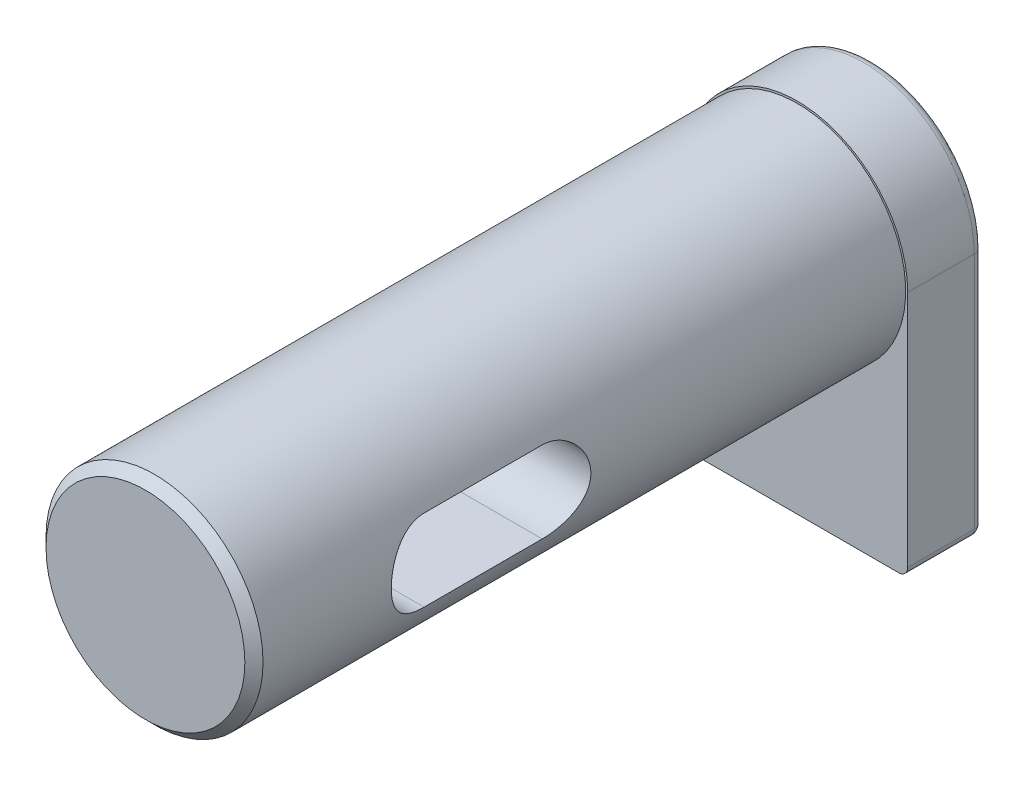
ISO-10303-21;
HEADER;
FILE_DESCRIPTION(('STEP AP214'),'2;1');
FILE_NAME('part.step','',(''),(''),'','','');
FILE_SCHEMA(('AUTOMOTIVE_DESIGN { 1 0 10303 214 1 1 1 1 }'));
ENDSEC;
DATA;
#1=APPLICATION_CONTEXT('core data for automotive mechanical design processes');
#2=APPLICATION_PROTOCOL_DEFINITION('international standard','automotive_design',2000,#1);
#3=PRODUCT_CONTEXT('',#1,'mechanical');
#4=PRODUCT('Part','Part','',(#3));
#5=PRODUCT_RELATED_PRODUCT_CATEGORY('part','',(#4));
#6=PRODUCT_DEFINITION_FORMATION('','',#4);
#7=PRODUCT_DEFINITION_CONTEXT('part definition',#1,'design');
#8=PRODUCT_DEFINITION('design','',#6,#7);
#9=PRODUCT_DEFINITION_SHAPE('','',#8);
#10=(LENGTH_UNIT() NAMED_UNIT(*) SI_UNIT(.MILLI.,.METRE.));
#11=(NAMED_UNIT(*) PLANE_ANGLE_UNIT() SI_UNIT($,.RADIAN.));
#12=(NAMED_UNIT(*) SI_UNIT($,.STERADIAN.) SOLID_ANGLE_UNIT());
#13=UNCERTAINTY_MEASURE_WITH_UNIT(LENGTH_MEASURE(1.E-05),#10,'distance_accuracy_value','');
#14=(GEOMETRIC_REPRESENTATION_CONTEXT(3) GLOBAL_UNCERTAINTY_ASSIGNED_CONTEXT((#13)) GLOBAL_UNIT_ASSIGNED_CONTEXT((#10,
#11,#12)) REPRESENTATION_CONTEXT('',''));
#15=CARTESIAN_POINT('',(0.,0.,0.));
#16=DIRECTION('',(0.,0.,1.));
#17=DIRECTION('',(1.,0.,0.));
#18=AXIS2_PLACEMENT_3D('',#15,#16,#17);
#19=CARTESIAN_POINT('',(0.,0.,3.302));
#20=DIRECTION('',(0.,0.,-1.));
#21=DIRECTION('',(-1.,0.,0.));
#22=AXIS2_PLACEMENT_3D('',#19,#20,#21);
#23=PLANE('',#22);
#24=CARTESIAN_POINT('',(0.,0.,3.302));
#25=DIRECTION('',(0.,0.,1.));
#26=DIRECTION('',(-1.,0.,0.));
#27=AXIS2_PLACEMENT_3D('',#24,#25,#26);
#28=CIRCLE('',#27,4.826);
#29=CARTESIAN_POINT('',(4.826,0.,3.302));
#30=VERTEX_POINT('',#29);
#31=CARTESIAN_POINT('',(-4.826,0.,3.302));
#32=VERTEX_POINT('',#31);
#33=EDGE_CURVE('E230',#30,#32,#28,.T.);
#34=ORIENTED_EDGE('',*,*,#33,.T.);
#35=DIRECTION('',(0.,-1.,0.));
#36=VECTOR('',#35,1.);
#37=CARTESIAN_POINT('',(-4.826,-10.398125,3.302));
#38=LINE('',#37,#36);
#39=CARTESIAN_POINT('',(-4.826,-10.398125,3.302));
#40=VERTEX_POINT('',#39);
#41=EDGE_CURVE('E228',#32,#40,#38,.T.);
#42=ORIENTED_EDGE('',*,*,#41,.T.);
#43=CARTESIAN_POINT('',(-4.429125,-10.398125,3.302));
#44=DIRECTION('',(0.,0.,1.));
#45=DIRECTION('',(-1.,0.,0.));
#46=AXIS2_PLACEMENT_3D('',#43,#44,#45);
#47=CIRCLE('',#46,0.396875);
#48=CARTESIAN_POINT('',(-4.429125,-10.795,3.302));
#49=VERTEX_POINT('',#48);
#50=EDGE_CURVE('E226',#40,#49,#47,.T.);
#51=ORIENTED_EDGE('',*,*,#50,.T.);
#52=DIRECTION('',(1.,0.,0.));
#53=VECTOR('',#52,1.);
#54=CARTESIAN_POINT('',(4.429125,-10.795,3.302));
#55=LINE('',#54,#53);
#56=CARTESIAN_POINT('',(4.429125,-10.795,3.302));
#57=VERTEX_POINT('',#56);
#58=EDGE_CURVE('E224',#49,#57,#55,.T.);
#59=ORIENTED_EDGE('',*,*,#58,.T.);
#60=CARTESIAN_POINT('',(4.429125,-10.398125,3.302));
#61=DIRECTION('',(0.,0.,1.));
#62=DIRECTION('',(-1.,0.,0.));
#63=AXIS2_PLACEMENT_3D('',#60,#61,#62);
#64=CIRCLE('',#63,0.396875);
#65=CARTESIAN_POINT('',(4.826,-10.398125,3.302));
#66=VERTEX_POINT('',#65);
#67=EDGE_CURVE('E222',#57,#66,#64,.T.);
#68=ORIENTED_EDGE('',*,*,#67,.T.);
#69=DIRECTION('',(0.,1.,0.));
#70=VECTOR('',#69,1.);
#71=CARTESIAN_POINT('',(4.826,0.,3.302));
#72=LINE('',#71,#70);
#73=EDGE_CURVE('E220',#66,#30,#72,.T.);
#74=ORIENTED_EDGE('',*,*,#73,.T.);
#75=EDGE_LOOP('',(#34,#42,#51,#59,#68,#74));
#76=FACE_BOUND('',#75,.T.);
#77=CARTESIAN_POINT('',(0.,0.,3.302));
#78=DIRECTION('',(0.,0.,-1.));
#79=DIRECTION('',(-1.,0.,0.));
#80=AXIS2_PLACEMENT_3D('',#77,#78,#79);
#81=CIRCLE('',#80,4.7371);
#82=CARTESIAN_POINT('',(-4.7371,0.,3.302));
#83=VERTEX_POINT('',#82);
#84=EDGE_CURVE('E202',#83,#83,#81,.F.);
#85=ORIENTED_EDGE('',*,*,#84,.F.);
#86=EDGE_LOOP('',(#85));
#87=FACE_BOUND('',#86,.T.);
#88=ADVANCED_FACE('F37',(#76,#87),#23,.F.);
#89=CARTESIAN_POINT('',(0.,0.,3.302));
#90=DIRECTION('',(0.,0.,-1.));
#91=DIRECTION('',(-1.,0.,0.));
#92=AXIS2_PLACEMENT_3D('',#89,#90,#91);
#93=CYLINDRICAL_SURFACE('',#92,4.826);
#94=DIRECTION('',(0.,0.,-1.));
#95=VECTOR('',#94,1.);
#96=CARTESIAN_POINT('',(4.826,0.,3.302));
#97=LINE('',#96,#95);
#98=CARTESIAN_POINT('',(4.826,0.,0.396875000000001));
#99=VERTEX_POINT('',#98);
#100=EDGE_CURVE('E218',#30,#99,#97,.T.);
#101=ORIENTED_EDGE('',*,*,#100,.T.);
#102=CARTESIAN_POINT('',(0.,0.,0.396875));
#103=DIRECTION('',(0.,0.,-1.));
#104=DIRECTION('',(-1.,0.,0.));
#105=AXIS2_PLACEMENT_3D('',#102,#103,#104);
#106=CIRCLE('',#105,4.826);
#107=CARTESIAN_POINT('',(-4.826,0.,0.396875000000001));
#108=VERTEX_POINT('',#107);
#109=EDGE_CURVE('E52',#99,#108,#106,.F.);
#110=ORIENTED_EDGE('',*,*,#109,.T.);
#111=DIRECTION('',(0.,0.,-1.));
#112=VECTOR('',#111,1.);
#113=CARTESIAN_POINT('',(-4.826,0.,3.302));
#114=LINE('',#113,#112);
#115=EDGE_CURVE('E205',#32,#108,#114,.T.);
#116=ORIENTED_EDGE('',*,*,#115,.F.);
#117=ORIENTED_EDGE('',*,*,#33,.F.);
#118=EDGE_LOOP('',(#101,#110,#116,#117));
#119=FACE_BOUND('',#118,.T.);
#120=ADVANCED_FACE('F246',(#119),#93,.T.);
#121=CARTESIAN_POINT('',(-4.826,-10.398125,3.302));
#122=DIRECTION('',(1.,0.,0.));
#123=DIRECTION('',(0.,1.,0.));
#124=AXIS2_PLACEMENT_3D('',#121,#122,#123);
#125=PLANE('',#124);
#126=ORIENTED_EDGE('',*,*,#115,.T.);
#127=DIRECTION('',(0.,-1.,0.));
#128=VECTOR('',#127,1.);
#129=CARTESIAN_POINT('',(-4.826,-10.398125,0.396875));
#130=LINE('',#129,#128);
#131=CARTESIAN_POINT('',(-4.826,-10.398125,0.396875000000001));
#132=VERTEX_POINT('',#131);
#133=EDGE_CURVE('E59',#108,#132,#130,.T.);
#134=ORIENTED_EDGE('',*,*,#133,.T.);
#135=DIRECTION('',(0.,0.,-1.));
#136=VECTOR('',#135,1.);
#137=CARTESIAN_POINT('',(-4.826,-10.398125,3.302));
#138=LINE('',#137,#136);
#139=EDGE_CURVE('E207',#40,#132,#138,.T.);
#140=ORIENTED_EDGE('',*,*,#139,.F.);
#141=ORIENTED_EDGE('',*,*,#41,.F.);
#142=EDGE_LOOP('',(#126,#134,#140,#141));
#143=FACE_BOUND('',#142,.T.);
#144=ADVANCED_FACE('F252',(#143),#125,.F.);
#145=CARTESIAN_POINT('',(-4.429125,-10.398125,3.302));
#146=DIRECTION('',(0.,0.,-1.));
#147=DIRECTION('',(-1.,0.,0.));
#148=AXIS2_PLACEMENT_3D('',#145,#146,#147);
#149=CYLINDRICAL_SURFACE('',#148,0.396875);
#150=ORIENTED_EDGE('',*,*,#139,.T.);
#151=CARTESIAN_POINT('',(-4.429125,-10.398125,0.396875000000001));
#152=DIRECTION('',(0.,0.,-1.));
#153=DIRECTION('',(-1.,0.,0.));
#154=AXIS2_PLACEMENT_3D('',#151,#152,#153);
#155=CIRCLE('',#154,0.396875);
#156=CARTESIAN_POINT('',(-4.429125,-10.795,0.396875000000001));
#157=VERTEX_POINT('',#156);
#158=EDGE_CURVE('E311',#132,#157,#155,.F.);
#159=ORIENTED_EDGE('',*,*,#158,.T.);
#160=DIRECTION('',(0.,0.,-1.));
#161=VECTOR('',#160,1.);
#162=CARTESIAN_POINT('',(-4.429125,-10.795,3.302));
#163=LINE('',#162,#161);
#164=EDGE_CURVE('E209',#49,#157,#163,.T.);
#165=ORIENTED_EDGE('',*,*,#164,.F.);
#166=ORIENTED_EDGE('',*,*,#50,.F.);
#167=EDGE_LOOP('',(#150,#159,#165,#166));
#168=FACE_BOUND('',#167,.T.);
#169=ADVANCED_FACE('F271',(#168),#149,.T.);
#170=CARTESIAN_POINT('',(4.429125,-10.795,3.302));
#171=DIRECTION('',(0.,1.,0.));
#172=DIRECTION('',(-1.,0.,0.));
#173=AXIS2_PLACEMENT_3D('',#170,#171,#172);
#174=PLANE('',#173);
#175=ORIENTED_EDGE('',*,*,#164,.T.);
#176=DIRECTION('',(1.,0.,0.));
#177=VECTOR('',#176,1.);
#178=CARTESIAN_POINT('',(4.429125,-10.795,0.396875));
#179=LINE('',#178,#177);
#180=CARTESIAN_POINT('',(4.429125,-10.795,0.396875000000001));
#181=VERTEX_POINT('',#180);
#182=EDGE_CURVE('E328',#157,#181,#179,.T.);
#183=ORIENTED_EDGE('',*,*,#182,.T.);
#184=DIRECTION('',(0.,0.,-1.));
#185=VECTOR('',#184,1.);
#186=CARTESIAN_POINT('',(4.429125,-10.795,3.302));
#187=LINE('',#186,#185);
#188=EDGE_CURVE('E212',#57,#181,#187,.T.);
#189=ORIENTED_EDGE('',*,*,#188,.F.);
#190=ORIENTED_EDGE('',*,*,#58,.F.);
#191=EDGE_LOOP('',(#175,#183,#189,#190));
#192=FACE_BOUND('',#191,.T.);
#193=ADVANCED_FACE('F267',(#192),#174,.F.);
#194=CARTESIAN_POINT('',(4.429125,-10.398125,3.302));
#195=DIRECTION('',(0.,0.,-1.));
#196=DIRECTION('',(-1.,0.,0.));
#197=AXIS2_PLACEMENT_3D('',#194,#195,#196);
#198=CYLINDRICAL_SURFACE('',#197,0.396875);
#199=ORIENTED_EDGE('',*,*,#188,.T.);
#200=CARTESIAN_POINT('',(4.429125,-10.398125,0.396875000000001));
#201=DIRECTION('',(0.,0.,-1.));
#202=DIRECTION('',(-1.,0.,0.));
#203=AXIS2_PLACEMENT_3D('',#200,#201,#202);
#204=CIRCLE('',#203,0.396875);
#205=CARTESIAN_POINT('',(4.826,-10.398125,0.396875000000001));
#206=VERTEX_POINT('',#205);
#207=EDGE_CURVE('E326',#181,#206,#204,.F.);
#208=ORIENTED_EDGE('',*,*,#207,.T.);
#209=DIRECTION('',(0.,0.,-1.));
#210=VECTOR('',#209,1.);
#211=CARTESIAN_POINT('',(4.826,-10.398125,3.302));
#212=LINE('',#211,#210);
#213=EDGE_CURVE('E215',#66,#206,#212,.T.);
#214=ORIENTED_EDGE('',*,*,#213,.F.);
#215=ORIENTED_EDGE('',*,*,#67,.F.);
#216=EDGE_LOOP('',(#199,#208,#214,#215));
#217=FACE_BOUND('',#216,.T.);
#218=ADVANCED_FACE('F263',(#217),#198,.T.);
#219=CARTESIAN_POINT('',(4.826,0.,3.302));
#220=DIRECTION('',(-1.,0.,0.));
#221=DIRECTION('',(0.,0.,1.));
#222=AXIS2_PLACEMENT_3D('',#219,#220,#221);
#223=PLANE('',#222);
#224=ORIENTED_EDGE('',*,*,#213,.T.);
#225=DIRECTION('',(0.,1.,0.));
#226=VECTOR('',#225,1.);
#227=CARTESIAN_POINT('',(4.826,0.,0.396875));
#228=LINE('',#227,#226);
#229=EDGE_CURVE('E155',#206,#99,#228,.T.);
#230=ORIENTED_EDGE('',*,*,#229,.T.);
#231=ORIENTED_EDGE('',*,*,#100,.F.);
#232=ORIENTED_EDGE('',*,*,#73,.F.);
#233=EDGE_LOOP('',(#224,#230,#231,#232));
#234=FACE_BOUND('',#233,.T.);
#235=ADVANCED_FACE('F259',(#234),#223,.F.);
#236=CARTESIAN_POINT('',(0.,0.,0.));
#237=DIRECTION('',(0.,0.,-1.));
#238=DIRECTION('',(-1.,0.,0.));
#239=AXIS2_PLACEMENT_3D('',#236,#237,#238);
#240=PLANE('',#239);
#241=CARTESIAN_POINT('',(0.,0.,0.));
#242=DIRECTION('',(0.,0.,-1.));
#243=DIRECTION('',(-1.,0.,0.));
#244=AXIS2_PLACEMENT_3D('',#241,#242,#243);
#245=CIRCLE('',#244,4.429125);
#246=CARTESIAN_POINT('',(-4.429125,0.,0.));
#247=VERTEX_POINT('',#246);
#248=CARTESIAN_POINT('',(4.429125,0.,0.));
#249=VERTEX_POINT('',#248);
#250=EDGE_CURVE('E158',#247,#249,#245,.T.);
#251=ORIENTED_EDGE('',*,*,#250,.T.);
#252=DIRECTION('',(0.,1.,0.));
#253=VECTOR('',#252,1.);
#254=CARTESIAN_POINT('',(4.429125,-10.398125,0.));
#255=LINE('',#254,#253);
#256=CARTESIAN_POINT('',(4.429125,-10.398125,0.));
#257=VERTEX_POINT('',#256);
#258=EDGE_CURVE('E321',#249,#257,#255,.F.);
#259=ORIENTED_EDGE('',*,*,#258,.T.);
#260=DIRECTION('',(1.,0.,0.));
#261=VECTOR('',#260,1.);
#262=CARTESIAN_POINT('',(-4.429125,-10.398125,0.));
#263=LINE('',#262,#261);
#264=CARTESIAN_POINT('',(-4.429125,-10.398125,0.));
#265=VERTEX_POINT('',#264);
#266=EDGE_CURVE('E319',#257,#265,#263,.F.);
#267=ORIENTED_EDGE('',*,*,#266,.T.);
#268=DIRECTION('',(0.,-1.,0.));
#269=VECTOR('',#268,1.);
#270=CARTESIAN_POINT('',(-4.429125,0.,0.));
#271=LINE('',#270,#269);
#272=EDGE_CURVE('E315',#265,#247,#271,.F.);
#273=ORIENTED_EDGE('',*,*,#272,.T.);
#274=EDGE_LOOP('',(#251,#259,#267,#273));
#275=FACE_BOUND('',#274,.T.);
#276=ADVANCED_FACE('F256',(#275),#240,.T.);
#277=CARTESIAN_POINT('',(0.,0.,31.75));
#278=DIRECTION('',(0.,0.,-1.));
#279=DIRECTION('',(-1.,0.,0.));
#280=AXIS2_PLACEMENT_3D('',#277,#278,#279);
#281=CYLINDRICAL_SURFACE('',#280,4.7371);
#282=CARTESIAN_POINT('',(0.,0.,31.353125));
#283=DIRECTION('',(0.,0.,1.));
#284=DIRECTION('',(1.,0.,0.));
#285=AXIS2_PLACEMENT_3D('',#282,#283,#284);
#286=CIRCLE('',#285,4.7371);
#287=CARTESIAN_POINT('',(4.7371,0.,31.353125));
#288=VERTEX_POINT('',#287);
#289=EDGE_CURVE('E11',#288,#288,#286,.F.);
#290=ORIENTED_EDGE('',*,*,#289,.T.);
#291=EDGE_LOOP('',(#290));
#292=FACE_BOUND('',#291,.T.);
#293=DIRECTION('',(0.,0.,-1.));
#294=VECTOR('',#293,1.);
#295=CARTESIAN_POINT('',(-4.39076672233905,1.778,31.75));
#296=LINE('',#295,#294);
#297=CARTESIAN_POINT('',(-4.39076672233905,1.778,18.8214));
#298=VERTEX_POINT('',#297);
#299=CARTESIAN_POINT('',(-4.39076672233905,1.778,23.9776));
#300=VERTEX_POINT('',#299);
#301=EDGE_CURVE('E154',#298,#300,#296,.F.);
#302=ORIENTED_EDGE('',*,*,#301,.T.);
#303=CARTESIAN_POINT('',(-4.39076672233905,1.778,23.9776));
#304=CARTESIAN_POINT('',(-4.39076101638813,1.77800177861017,24.0257122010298));
#305=CARTESIAN_POINT('',(-4.39155851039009,1.77604588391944,24.0737993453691));
#306=CARTESIAN_POINT('',(-4.39470256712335,1.76825685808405,24.1695916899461));
#307=CARTESIAN_POINT('',(-4.39704860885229,1.76242503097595,24.2172970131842));
#308=CARTESIAN_POINT('',(-4.40629711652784,1.73923930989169,24.3589727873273));
#309=CARTESIAN_POINT('',(-4.41541098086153,1.71619438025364,24.4519337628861));
#310=CARTESIAN_POINT('',(-4.43840290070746,1.65581472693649,24.6322881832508));
#311=CARTESIAN_POINT('',(-4.45227692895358,1.61849207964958,24.7196862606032));
#312=CARTESIAN_POINT('',(-4.48321287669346,1.53071219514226,24.8870731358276));
#313=CARTESIAN_POINT('',(-4.5002774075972,1.48024418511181,24.9670557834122));
#314=CARTESIAN_POINT('',(-4.53661338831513,1.36494064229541,25.121235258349));
#315=CARTESIAN_POINT('',(-4.55594960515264,1.2995606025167,25.1950095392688));
#316=CARTESIAN_POINT('',(-4.59411036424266,1.15744330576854,25.3308455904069));
#317=CARTESIAN_POINT('',(-4.61293480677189,1.0807038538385,25.3929050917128));
#318=CARTESIAN_POINT('',(-4.64872609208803,0.914818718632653,25.5055985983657));
#319=CARTESIAN_POINT('',(-4.66560763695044,0.825339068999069,25.555770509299));
#320=CARTESIAN_POINT('',(-4.6948271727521,0.638466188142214,25.6401717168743));
#321=CARTESIAN_POINT('',(-4.70716685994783,0.54107592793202,25.6744069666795));
#322=CARTESIAN_POINT('',(-4.72545075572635,0.345608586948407,25.7244751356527));
#323=CARTESIAN_POINT('',(-4.73164821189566,0.247742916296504,25.74103912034));
#324=CARTESIAN_POINT('',(-4.73785837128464,0.0504360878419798,25.7576373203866));
#325=CARTESIAN_POINT('',(-4.73787298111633,-0.049004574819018,25.7576766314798));
#326=CARTESIAN_POINT('',(-4.73187654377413,-0.241395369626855,25.7416491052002));
#327=CARTESIAN_POINT('',(-4.72616410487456,-0.334422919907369,25.7263804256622));
#328=CARTESIAN_POINT('',(-4.70974733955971,-0.516482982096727,25.6815134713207));
#329=CARTESIAN_POINT('',(-4.6990427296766,-0.605515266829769,25.6519143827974));
#330=CARTESIAN_POINT('',(-4.67350739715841,-0.778598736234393,25.5788567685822));
#331=CARTESIAN_POINT('',(-4.65861884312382,-0.86255847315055,25.535202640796));
#332=CARTESIAN_POINT('',(-4.62622180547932,-1.02216956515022,25.435446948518));
#333=CARTESIAN_POINT('',(-4.60871246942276,-1.09781820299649,25.3793413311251));
#334=CARTESIAN_POINT('',(-4.57166845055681,-1.24335466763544,25.2524377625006));
#335=CARTESIAN_POINT('',(-4.55207520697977,-1.3126461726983,25.180972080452));
#336=CARTESIAN_POINT('',(-4.51388758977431,-1.43849617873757,25.0273039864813));
#337=CARTESIAN_POINT('',(-4.49529361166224,-1.49504966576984,24.9450973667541));
#338=CARTESIAN_POINT('',(-4.4608342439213,-1.59497319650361,24.7699037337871));
#339=CARTESIAN_POINT('',(-4.44504064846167,-1.63801362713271,24.6767138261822));
#340=CARTESIAN_POINT('',(-4.41881219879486,-1.707517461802,24.4837072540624));
#341=CARTESIAN_POINT('',(-4.40836833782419,-1.73400874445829,24.3839020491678));
#342=CARTESIAN_POINT('',(-4.39785193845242,-1.76042427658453,24.232169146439));
#343=CARTESIAN_POINT('',(-4.39520526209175,-1.7670090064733,24.1814960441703));
#344=CARTESIAN_POINT('',(-4.39165988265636,-1.77579589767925,24.0797585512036));
#345=CARTESIAN_POINT('',(-4.39075956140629,-1.7780021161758,24.0286945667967));
#346=CARTESIAN_POINT('',(-4.39076672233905,-1.778,23.9776));
#347=B_SPLINE_CURVE_WITH_KNOTS('',3,(#303,#304,#305,#306,#307,#308,#309,#310,#311,#312,#313,
#314,#315,#316,#317,#318,#319,#320,#321,#322,#323,#324,#325,#326,#327,#328,#329,#330,#331,#332,
#333,#334,#335,#336,#337,#338,#339,#340,#341,#342,#343,#344,#345,#346),.UNSPECIFIED.,.F.,.F.,(4,
2,2,2,2,2,2,2,2,2,2,2,2,2,2,2,2,2,2,2,2,4),(0.,0.144241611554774,0.288434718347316,
0.575546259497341,0.86241549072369,1.14952055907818,1.44955021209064,1.74963791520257,
2.05996477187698,2.370175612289,2.66698582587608,2.96370451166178,3.2457171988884,
3.52774590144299,3.81388275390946,4.1001128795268,4.40309580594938,4.70619778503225,
5.01620340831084,5.32568537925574,5.47899648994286,5.63216547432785),.UNSPECIFIED.);
#348=CARTESIAN_POINT('',(-4.39076672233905,-1.778,23.9776));
#349=VERTEX_POINT('',#348);
#350=EDGE_CURVE('E145',#300,#349,#347,.T.);
#351=ORIENTED_EDGE('',*,*,#350,.T.);
#352=DIRECTION('',(0.,0.,-1.));
#353=VECTOR('',#352,1.);
#354=CARTESIAN_POINT('',(-4.39076672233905,-1.778,31.75));
#355=LINE('',#354,#353);
#356=CARTESIAN_POINT('',(-4.39076672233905,-1.778,18.8214));
#357=VERTEX_POINT('',#356);
#358=EDGE_CURVE('E128',#349,#357,#355,.T.);
#359=ORIENTED_EDGE('',*,*,#358,.T.);
#360=CARTESIAN_POINT('',(-4.39076672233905,-1.778,18.8214));
#361=CARTESIAN_POINT('',(-4.39076101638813,-1.77800177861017,18.7732877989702));
#362=CARTESIAN_POINT('',(-4.39155851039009,-1.77604588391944,18.7252006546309));
#363=CARTESIAN_POINT('',(-4.39470256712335,-1.76825685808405,18.6294083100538));
#364=CARTESIAN_POINT('',(-4.39704860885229,-1.76242503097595,18.5817029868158));
#365=CARTESIAN_POINT('',(-4.40629711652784,-1.73923930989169,18.4400272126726));
#366=CARTESIAN_POINT('',(-4.41541098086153,-1.71619438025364,18.3470662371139));
#367=CARTESIAN_POINT('',(-4.43840290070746,-1.65581472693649,18.1667118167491));
#368=CARTESIAN_POINT('',(-4.45227692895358,-1.61849207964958,18.0793137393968));
#369=CARTESIAN_POINT('',(-4.48321287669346,-1.53071219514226,17.9119268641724));
#370=CARTESIAN_POINT('',(-4.5002774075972,-1.48024418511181,17.8319442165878));
#371=CARTESIAN_POINT('',(-4.53661338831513,-1.36494064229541,17.6777647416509));
#372=CARTESIAN_POINT('',(-4.55594960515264,-1.2995606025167,17.6039904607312));
#373=CARTESIAN_POINT('',(-4.59411036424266,-1.15744330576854,17.4681544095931));
#374=CARTESIAN_POINT('',(-4.61293480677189,-1.0807038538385,17.4060949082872));
#375=CARTESIAN_POINT('',(-4.64872609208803,-0.914818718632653,17.2934014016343));
#376=CARTESIAN_POINT('',(-4.66560763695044,-0.825339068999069,17.243229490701));
#377=CARTESIAN_POINT('',(-4.6948271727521,-0.638466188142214,17.1588282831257));
#378=CARTESIAN_POINT('',(-4.70716685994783,-0.54107592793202,17.1245930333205));
#379=CARTESIAN_POINT('',(-4.72545075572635,-0.345608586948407,17.0745248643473));
#380=CARTESIAN_POINT('',(-4.73164821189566,-0.247742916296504,17.05796087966));
#381=CARTESIAN_POINT('',(-4.73785837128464,-0.0504360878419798,17.0413626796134));
#382=CARTESIAN_POINT('',(-4.73787298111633,0.049004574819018,17.0413233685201));
#383=CARTESIAN_POINT('',(-4.73187654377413,0.241395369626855,17.0573508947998));
#384=CARTESIAN_POINT('',(-4.72616410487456,0.33442291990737,17.0726195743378));
#385=CARTESIAN_POINT('',(-4.70974733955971,0.516482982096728,17.1174865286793));
#386=CARTESIAN_POINT('',(-4.6990427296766,0.605515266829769,17.1470856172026));
#387=CARTESIAN_POINT('',(-4.67350739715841,0.778598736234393,17.2201432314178));
#388=CARTESIAN_POINT('',(-4.65861884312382,0.86255847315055,17.263797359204));
#389=CARTESIAN_POINT('',(-4.62622180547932,1.02216956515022,17.363553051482));
#390=CARTESIAN_POINT('',(-4.60871246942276,1.09781820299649,17.4196586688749));
#391=CARTESIAN_POINT('',(-4.57166845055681,1.24335466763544,17.5465622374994));
#392=CARTESIAN_POINT('',(-4.55207520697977,1.3126461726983,17.618027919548));
#393=CARTESIAN_POINT('',(-4.51388758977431,1.43849617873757,17.7716960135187));
#394=CARTESIAN_POINT('',(-4.49529361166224,1.49504966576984,17.8539026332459));
#395=CARTESIAN_POINT('',(-4.46083424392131,1.59497319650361,18.0290962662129));
#396=CARTESIAN_POINT('',(-4.44504064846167,1.63801362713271,18.1222861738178));
#397=CARTESIAN_POINT('',(-4.41881219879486,1.707517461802,18.3152927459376));
#398=CARTESIAN_POINT('',(-4.40836833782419,1.73400874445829,18.4150979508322));
#399=CARTESIAN_POINT('',(-4.39785193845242,1.76042427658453,18.566830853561));
#400=CARTESIAN_POINT('',(-4.39520526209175,1.7670090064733,18.6175039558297));
#401=CARTESIAN_POINT('',(-4.39165988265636,1.77579589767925,18.7192414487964));
#402=CARTESIAN_POINT('',(-4.39075956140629,1.7780021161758,18.7703054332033));
#403=CARTESIAN_POINT('',(-4.39076672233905,1.778,18.8214));
#404=B_SPLINE_CURVE_WITH_KNOTS('',3,(#360,#361,#362,#363,#364,#365,#366,#367,#368,#369,#370,
#371,#372,#373,#374,#375,#376,#377,#378,#379,#380,#381,#382,#383,#384,#385,#386,#387,#388,#389,
#390,#391,#392,#393,#394,#395,#396,#397,#398,#399,#400,#401,#402,#403),.UNSPECIFIED.,.F.,.F.,(4,
2,2,2,2,2,2,2,2,2,2,2,2,2,2,2,2,2,2,2,2,4),(0.,0.144241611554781,0.28843471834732,
0.575546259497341,0.862415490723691,1.14952055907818,1.44955021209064,1.74963791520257,
2.05996477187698,2.370175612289,2.66698582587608,2.96370451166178,3.2457171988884,
3.52774590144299,3.81388275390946,4.1001128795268,4.40309580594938,4.70619778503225,
5.01620340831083,5.32568537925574,5.47899648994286,5.63216547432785),.UNSPECIFIED.);
#405=EDGE_CURVE('E139',#357,#298,#404,.T.);
#406=ORIENTED_EDGE('',*,*,#405,.T.);
#407=EDGE_LOOP('',(#302,#351,#359,#406));
#408=FACE_BOUND('',#407,.T.);
#409=DIRECTION('',(0.,0.,-1.));
#410=VECTOR('',#409,1.);
#411=CARTESIAN_POINT('',(4.39076672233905,-1.778,31.75));
#412=LINE('',#411,#410);
#413=CARTESIAN_POINT('',(4.39076672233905,-1.778,18.8214));
#414=VERTEX_POINT('',#413);
#415=CARTESIAN_POINT('',(4.39076672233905,-1.778,23.9776));
#416=VERTEX_POINT('',#415);
#417=EDGE_CURVE('E200',#414,#416,#412,.F.);
#418=ORIENTED_EDGE('',*,*,#417,.T.);
#419=CARTESIAN_POINT('',(4.39076672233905,-1.778,23.9776));
#420=CARTESIAN_POINT('',(4.39076101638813,-1.77800177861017,24.0257122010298));
#421=CARTESIAN_POINT('',(4.39155851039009,-1.77604588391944,24.0737993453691));
#422=CARTESIAN_POINT('',(4.39470256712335,-1.76825685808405,24.1695916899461));
#423=CARTESIAN_POINT('',(4.39704860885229,-1.76242503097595,24.2172970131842));
#424=CARTESIAN_POINT('',(4.40629711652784,-1.73923930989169,24.3589727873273));
#425=CARTESIAN_POINT('',(4.41541098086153,-1.71619438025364,24.4519337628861));
#426=CARTESIAN_POINT('',(4.43840290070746,-1.65581472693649,24.6322881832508));
#427=CARTESIAN_POINT('',(4.45227692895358,-1.61849207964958,24.7196862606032));
#428=CARTESIAN_POINT('',(4.48321287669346,-1.53071219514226,24.8870731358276));
#429=CARTESIAN_POINT('',(4.5002774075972,-1.48024418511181,24.9670557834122));
#430=CARTESIAN_POINT('',(4.53661338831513,-1.36494064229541,25.121235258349));
#431=CARTESIAN_POINT('',(4.55594960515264,-1.2995606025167,25.1950095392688));
#432=CARTESIAN_POINT('',(4.59411036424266,-1.15744330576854,25.3308455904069));
#433=CARTESIAN_POINT('',(4.61293480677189,-1.0807038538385,25.3929050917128));
#434=CARTESIAN_POINT('',(4.64872609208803,-0.914818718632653,25.5055985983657));
#435=CARTESIAN_POINT('',(4.66560763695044,-0.825339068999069,25.555770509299));
#436=CARTESIAN_POINT('',(4.6948271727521,-0.638466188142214,25.6401717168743));
#437=CARTESIAN_POINT('',(4.70716685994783,-0.54107592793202,25.6744069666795));
#438=CARTESIAN_POINT('',(4.72545075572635,-0.345608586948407,25.7244751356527));
#439=CARTESIAN_POINT('',(4.73164821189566,-0.247742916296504,25.74103912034));
#440=CARTESIAN_POINT('',(4.73785837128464,-0.0504360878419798,25.7576373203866));
#441=CARTESIAN_POINT('',(4.73787298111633,0.049004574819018,25.7576766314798));
#442=CARTESIAN_POINT('',(4.73187654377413,0.241395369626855,25.7416491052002));
#443=CARTESIAN_POINT('',(4.72616410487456,0.334422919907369,25.7263804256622));
#444=CARTESIAN_POINT('',(4.70974733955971,0.516482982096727,25.6815134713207));
#445=CARTESIAN_POINT('',(4.6990427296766,0.605515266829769,25.6519143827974));
#446=CARTESIAN_POINT('',(4.67350739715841,0.778598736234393,25.5788567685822));
#447=CARTESIAN_POINT('',(4.65861884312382,0.86255847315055,25.535202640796));
#448=CARTESIAN_POINT('',(4.62622180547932,1.02216956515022,25.435446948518));
#449=CARTESIAN_POINT('',(4.60871246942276,1.09781820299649,25.3793413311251));
#450=CARTESIAN_POINT('',(4.57166845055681,1.24335466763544,25.2524377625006));
#451=CARTESIAN_POINT('',(4.55207520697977,1.3126461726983,25.180972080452));
#452=CARTESIAN_POINT('',(4.51388758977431,1.43849617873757,25.0273039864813));
#453=CARTESIAN_POINT('',(4.49529361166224,1.49504966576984,24.9450973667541));
#454=CARTESIAN_POINT('',(4.4608342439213,1.59497319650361,24.7699037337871));
#455=CARTESIAN_POINT('',(4.44504064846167,1.63801362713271,24.6767138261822));
#456=CARTESIAN_POINT('',(4.41881219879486,1.707517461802,24.4837072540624));
#457=CARTESIAN_POINT('',(4.40836833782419,1.73400874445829,24.3839020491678));
#458=CARTESIAN_POINT('',(4.39785193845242,1.76042427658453,24.232169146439));
#459=CARTESIAN_POINT('',(4.39520526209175,1.7670090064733,24.1814960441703));
#460=CARTESIAN_POINT('',(4.39165988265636,1.77579589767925,24.0797585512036));
#461=CARTESIAN_POINT('',(4.39075956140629,1.7780021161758,24.0286945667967));
#462=CARTESIAN_POINT('',(4.39076672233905,1.778,23.9776));
#463=B_SPLINE_CURVE_WITH_KNOTS('',3,(#419,#420,#421,#422,#423,#424,#425,#426,#427,#428,#429,
#430,#431,#432,#433,#434,#435,#436,#437,#438,#439,#440,#441,#442,#443,#444,#445,#446,#447,#448,
#449,#450,#451,#452,#453,#454,#455,#456,#457,#458,#459,#460,#461,#462),.UNSPECIFIED.,.F.,.F.,(4,
2,2,2,2,2,2,2,2,2,2,2,2,2,2,2,2,2,2,2,2,4),(0.,0.144241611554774,0.288434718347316,
0.575546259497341,0.86241549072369,1.14952055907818,1.44955021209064,1.74963791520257,
2.05996477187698,2.370175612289,2.66698582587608,2.96370451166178,3.2457171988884,
3.52774590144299,3.81388275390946,4.1001128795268,4.40309580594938,4.70619778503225,
5.01620340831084,5.32568537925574,5.47899648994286,5.63216547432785),.UNSPECIFIED.);
#464=CARTESIAN_POINT('',(4.39076672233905,1.778,23.9776));
#465=VERTEX_POINT('',#464);
#466=EDGE_CURVE('E140',#416,#465,#463,.T.);
#467=ORIENTED_EDGE('',*,*,#466,.T.);
#468=DIRECTION('',(0.,0.,-1.));
#469=VECTOR('',#468,1.);
#470=CARTESIAN_POINT('',(4.39076672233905,1.778,31.75));
#471=LINE('',#470,#469);
#472=CARTESIAN_POINT('',(4.39076672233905,1.778,18.8214));
#473=VERTEX_POINT('',#472);
#474=EDGE_CURVE('E183',#465,#473,#471,.T.);
#475=ORIENTED_EDGE('',*,*,#474,.T.);
#476=CARTESIAN_POINT('',(4.39076672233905,1.778,18.8214));
#477=CARTESIAN_POINT('',(4.39076101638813,1.77800177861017,18.7732877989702));
#478=CARTESIAN_POINT('',(4.39155851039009,1.77604588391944,18.7252006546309));
#479=CARTESIAN_POINT('',(4.39470256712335,1.76825685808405,18.6294083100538));
#480=CARTESIAN_POINT('',(4.39704860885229,1.76242503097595,18.5817029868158));
#481=CARTESIAN_POINT('',(4.40629711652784,1.73923930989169,18.4400272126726));
#482=CARTESIAN_POINT('',(4.41541098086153,1.71619438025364,18.3470662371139));
#483=CARTESIAN_POINT('',(4.43840290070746,1.65581472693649,18.1667118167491));
#484=CARTESIAN_POINT('',(4.45227692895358,1.61849207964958,18.0793137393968));
#485=CARTESIAN_POINT('',(4.48321287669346,1.53071219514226,17.9119268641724));
#486=CARTESIAN_POINT('',(4.5002774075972,1.48024418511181,17.8319442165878));
#487=CARTESIAN_POINT('',(4.53661338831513,1.36494064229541,17.6777647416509));
#488=CARTESIAN_POINT('',(4.55594960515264,1.2995606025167,17.6039904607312));
#489=CARTESIAN_POINT('',(4.59411036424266,1.15744330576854,17.4681544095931));
#490=CARTESIAN_POINT('',(4.61293480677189,1.0807038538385,17.4060949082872));
#491=CARTESIAN_POINT('',(4.64872609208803,0.914818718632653,17.2934014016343));
#492=CARTESIAN_POINT('',(4.66560763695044,0.825339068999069,17.243229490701));
#493=CARTESIAN_POINT('',(4.6948271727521,0.638466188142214,17.1588282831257));
#494=CARTESIAN_POINT('',(4.70716685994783,0.54107592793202,17.1245930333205));
#495=CARTESIAN_POINT('',(4.72545075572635,0.345608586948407,17.0745248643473));
#496=CARTESIAN_POINT('',(4.73164821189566,0.247742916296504,17.05796087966));
#497=CARTESIAN_POINT('',(4.73785837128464,0.0504360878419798,17.0413626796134));
#498=CARTESIAN_POINT('',(4.73787298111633,-0.049004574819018,17.0413233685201));
#499=CARTESIAN_POINT('',(4.73187654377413,-0.241395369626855,17.0573508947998));
#500=CARTESIAN_POINT('',(4.72616410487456,-0.33442291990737,17.0726195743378));
#501=CARTESIAN_POINT('',(4.70974733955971,-0.516482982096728,17.1174865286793));
#502=CARTESIAN_POINT('',(4.6990427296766,-0.605515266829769,17.1470856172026));
#503=CARTESIAN_POINT('',(4.67350739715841,-0.778598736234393,17.2201432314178));
#504=CARTESIAN_POINT('',(4.65861884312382,-0.86255847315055,17.263797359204));
#505=CARTESIAN_POINT('',(4.62622180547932,-1.02216956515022,17.363553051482));
#506=CARTESIAN_POINT('',(4.60871246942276,-1.09781820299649,17.4196586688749));
#507=CARTESIAN_POINT('',(4.57166845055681,-1.24335466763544,17.5465622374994));
#508=CARTESIAN_POINT('',(4.55207520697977,-1.3126461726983,17.618027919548));
#509=CARTESIAN_POINT('',(4.51388758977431,-1.43849617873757,17.7716960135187));
#510=CARTESIAN_POINT('',(4.49529361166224,-1.49504966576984,17.8539026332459));
#511=CARTESIAN_POINT('',(4.46083424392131,-1.59497319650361,18.0290962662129));
#512=CARTESIAN_POINT('',(4.44504064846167,-1.63801362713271,18.1222861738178));
#513=CARTESIAN_POINT('',(4.41881219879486,-1.707517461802,18.3152927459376));
#514=CARTESIAN_POINT('',(4.40836833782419,-1.73400874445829,18.4150979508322));
#515=CARTESIAN_POINT('',(4.39785193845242,-1.76042427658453,18.566830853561));
#516=CARTESIAN_POINT('',(4.39520526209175,-1.7670090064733,18.6175039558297));
#517=CARTESIAN_POINT('',(4.39165988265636,-1.77579589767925,18.7192414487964));
#518=CARTESIAN_POINT('',(4.39075956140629,-1.7780021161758,18.7703054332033));
#519=CARTESIAN_POINT('',(4.39076672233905,-1.778,18.8214));
#520=B_SPLINE_CURVE_WITH_KNOTS('',3,(#476,#477,#478,#479,#480,#481,#482,#483,#484,#485,#486,
#487,#488,#489,#490,#491,#492,#493,#494,#495,#496,#497,#498,#499,#500,#501,#502,#503,#504,#505,
#506,#507,#508,#509,#510,#511,#512,#513,#514,#515,#516,#517,#518,#519),.UNSPECIFIED.,.F.,.F.,(4,
2,2,2,2,2,2,2,2,2,2,2,2,2,2,2,2,2,2,2,2,4),(0.,0.144241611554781,0.28843471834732,
0.575546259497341,0.862415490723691,1.14952055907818,1.44955021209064,1.74963791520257,
2.05996477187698,2.370175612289,2.66698582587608,2.96370451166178,3.2457171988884,
3.52774590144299,3.81388275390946,4.1001128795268,4.40309580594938,4.70619778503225,
5.01620340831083,5.32568537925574,5.47899648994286,5.63216547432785),.UNSPECIFIED.);
#521=EDGE_CURVE('E194',#473,#414,#520,.T.);
#522=ORIENTED_EDGE('',*,*,#521,.T.);
#523=EDGE_LOOP('',(#418,#467,#475,#522));
#524=FACE_BOUND('',#523,.T.);
#525=ORIENTED_EDGE('',*,*,#84,.T.);
#526=EDGE_LOOP('',(#525));
#527=FACE_BOUND('',#526,.T.);
#528=ADVANCED_FACE('F152',(#292,#408,#524,#527),#281,.T.);
#529=CARTESIAN_POINT('',(0.,0.,31.75));
#530=DIRECTION('',(0.,0.,1.));
#531=DIRECTION('',(1.,0.,0.));
#532=AXIS2_PLACEMENT_3D('',#529,#530,#531);
#533=PLANE('',#532);
#534=CARTESIAN_POINT('',(0.,0.,31.75));
#535=DIRECTION('',(0.,0.,1.));
#536=DIRECTION('',(1.,0.,0.));
#537=AXIS2_PLACEMENT_3D('',#534,#535,#536);
#538=CIRCLE('',#537,4.340225);
#539=CARTESIAN_POINT('',(4.340225,0.,31.75));
#540=VERTEX_POINT('',#539);
#541=EDGE_CURVE('E45',#540,#540,#538,.T.);
#542=ORIENTED_EDGE('',*,*,#541,.T.);
#543=EDGE_LOOP('',(#542));
#544=FACE_BOUND('',#543,.T.);
#545=ADVANCED_FACE('F175',(#544),#533,.T.);
#546=CARTESIAN_POINT('',(-14.224,0.,23.9776));
#547=DIRECTION('',(1.,0.,0.));
#548=DIRECTION('',(0.,0.,-1.));
#549=AXIS2_PLACEMENT_3D('',#546,#547,#548);
#550=CYLINDRICAL_SURFACE('',#549,1.778);
#551=DIRECTION('',(1.,0.,0.));
#552=VECTOR('',#551,1.);
#553=CARTESIAN_POINT('',(-14.224,-1.778,23.9776));
#554=LINE('',#553,#552);
#555=EDGE_CURVE('E131',#349,#416,#554,.T.);
#556=ORIENTED_EDGE('',*,*,#555,.F.);
#557=ORIENTED_EDGE('',*,*,#350,.F.);
#558=DIRECTION('',(1.,0.,0.));
#559=VECTOR('',#558,1.);
#560=CARTESIAN_POINT('',(-14.224,1.778,23.9776));
#561=LINE('',#560,#559);
#562=EDGE_CURVE('E232',#300,#465,#561,.T.);
#563=ORIENTED_EDGE('',*,*,#562,.T.);
#564=ORIENTED_EDGE('',*,*,#466,.F.);
#565=EDGE_LOOP('',(#556,#557,#563,#564));
#566=FACE_BOUND('',#565,.T.);
#567=ADVANCED_FACE('F143',(#566),#550,.F.);
#568=CARTESIAN_POINT('',(-14.224,1.778,23.9776));
#569=DIRECTION('',(0.,1.,0.));
#570=DIRECTION('',(0.,0.,1.));
#571=AXIS2_PLACEMENT_3D('',#568,#569,#570);
#572=PLANE('',#571);
#573=ORIENTED_EDGE('',*,*,#562,.F.);
#574=ORIENTED_EDGE('',*,*,#301,.F.);
#575=DIRECTION('',(1.,0.,0.));
#576=VECTOR('',#575,1.);
#577=CARTESIAN_POINT('',(-14.224,1.778,18.8214));
#578=LINE('',#577,#576);
#579=EDGE_CURVE('E235',#298,#473,#578,.T.);
#580=ORIENTED_EDGE('',*,*,#579,.T.);
#581=ORIENTED_EDGE('',*,*,#474,.F.);
#582=EDGE_LOOP('',(#573,#574,#580,#581));
#583=FACE_BOUND('',#582,.T.);
#584=ADVANCED_FACE('F174',(#583),#572,.F.);
#585=CARTESIAN_POINT('',(-14.224,0.,18.8214));
#586=DIRECTION('',(1.,0.,0.));
#587=DIRECTION('',(0.,0.,-1.));
#588=AXIS2_PLACEMENT_3D('',#585,#586,#587);
#589=CYLINDRICAL_SURFACE('',#588,1.778);
#590=ORIENTED_EDGE('',*,*,#579,.F.);
#591=ORIENTED_EDGE('',*,*,#405,.F.);
#592=DIRECTION('',(1.,0.,0.));
#593=VECTOR('',#592,1.);
#594=CARTESIAN_POINT('',(-14.224,-1.778,18.8214));
#595=LINE('',#594,#593);
#596=EDGE_CURVE('E134',#357,#414,#595,.T.);
#597=ORIENTED_EDGE('',*,*,#596,.T.);
#598=ORIENTED_EDGE('',*,*,#521,.F.);
#599=EDGE_LOOP('',(#590,#591,#597,#598));
#600=FACE_BOUND('',#599,.T.);
#601=ADVANCED_FACE('F188',(#600),#589,.F.);
#602=CARTESIAN_POINT('',(-14.224,-1.778,23.9776));
#603=DIRECTION('',(0.,-1.,0.));
#604=DIRECTION('',(0.,0.,-1.));
#605=AXIS2_PLACEMENT_3D('',#602,#603,#604);
#606=PLANE('',#605);
#607=ORIENTED_EDGE('',*,*,#555,.T.);
#608=ORIENTED_EDGE('',*,*,#417,.F.);
#609=ORIENTED_EDGE('',*,*,#596,.F.);
#610=ORIENTED_EDGE('',*,*,#358,.F.);
#611=EDGE_LOOP('',(#607,#608,#609,#610));
#612=FACE_BOUND('',#611,.T.);
#613=ADVANCED_FACE('F130',(#612),#606,.F.);
#614=CARTESIAN_POINT('',(-4.429125,-10.398125,0.396875));
#615=DIRECTION('',(0.,0.,1.));
#616=DIRECTION('',(1.,0.,0.));
#617=AXIS2_PLACEMENT_3D('',#614,#615,#616);
#618=SPHERICAL_SURFACE('',#617,0.396875);
#619=CARTESIAN_POINT('',(-4.429125,-10.398125,0.396875));
#620=DIRECTION('',(0.,1.,0.));
#621=DIRECTION('',(-1.,0.,0.));
#622=AXIS2_PLACEMENT_3D('',#619,#620,#621);
#623=CIRCLE('',#622,0.396875);
#624=EDGE_CURVE('E307',#265,#132,#623,.T.);
#625=ORIENTED_EDGE('',*,*,#624,.F.);
#626=CARTESIAN_POINT('',(-4.429125,-10.398125,0.396875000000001));
#627=DIRECTION('',(1.,0.,0.));
#628=DIRECTION('',(0.,1.,0.));
#629=AXIS2_PLACEMENT_3D('',#626,#627,#628);
#630=CIRCLE('',#629,0.396875);
#631=EDGE_CURVE('E149',#157,#265,#630,.T.);
#632=ORIENTED_EDGE('',*,*,#631,.F.);
#633=ORIENTED_EDGE('',*,*,#158,.F.);
#634=EDGE_LOOP('',(#625,#632,#633));
#635=FACE_BOUND('',#634,.T.);
#636=ADVANCED_FACE('F296',(#635),#618,.T.);
#637=CARTESIAN_POINT('',(4.429125,-10.398125,0.396875));
#638=DIRECTION('',(-1.,0.,0.));
#639=DIRECTION('',(0.,-1.,0.));
#640=AXIS2_PLACEMENT_3D('',#637,#638,#639);
#641=CYLINDRICAL_SURFACE('',#640,0.396875);
#642=ORIENTED_EDGE('',*,*,#631,.T.);
#643=ORIENTED_EDGE('',*,*,#266,.F.);
#644=CARTESIAN_POINT('',(4.429125,-10.398125,0.396875));
#645=DIRECTION('',(1.,0.,0.));
#646=DIRECTION('',(0.,0.,-1.));
#647=AXIS2_PLACEMENT_3D('',#644,#645,#646);
#648=CIRCLE('',#647,0.396875);
#649=EDGE_CURVE('E312',#181,#257,#648,.T.);
#650=ORIENTED_EDGE('',*,*,#649,.F.);
#651=ORIENTED_EDGE('',*,*,#182,.F.);
#652=EDGE_LOOP('',(#642,#643,#650,#651));
#653=FACE_BOUND('',#652,.T.);
#654=ADVANCED_FACE('F293',(#653),#641,.T.);
#655=CARTESIAN_POINT('',(-4.429125,-10.398125,0.396875));
#656=DIRECTION('',(0.,1.,0.));
#657=DIRECTION('',(-1.,0.,0.));
#658=AXIS2_PLACEMENT_3D('',#655,#656,#657);
#659=CYLINDRICAL_SURFACE('',#658,0.396875);
#660=ORIENTED_EDGE('',*,*,#624,.T.);
#661=ORIENTED_EDGE('',*,*,#133,.F.);
#662=CARTESIAN_POINT('',(-4.429125,0.,0.396875));
#663=DIRECTION('',(0.,1.,0.));
#664=DIRECTION('',(-1.,0.,0.));
#665=AXIS2_PLACEMENT_3D('',#662,#663,#664);
#666=CIRCLE('',#665,0.396875);
#667=EDGE_CURVE('E317',#247,#108,#666,.T.);
#668=ORIENTED_EDGE('',*,*,#667,.F.);
#669=ORIENTED_EDGE('',*,*,#272,.F.);
#670=EDGE_LOOP('',(#660,#661,#668,#669));
#671=FACE_BOUND('',#670,.T.);
#672=ADVANCED_FACE('F289',(#671),#659,.T.);
#673=CARTESIAN_POINT('',(4.429125,-10.398125,0.396875));
#674=DIRECTION('',(0.,0.,1.));
#675=DIRECTION('',(1.,0.,0.));
#676=AXIS2_PLACEMENT_3D('',#673,#674,#675);
#677=SPHERICAL_SURFACE('',#676,0.396875);
#678=ORIENTED_EDGE('',*,*,#207,.F.);
#679=ORIENTED_EDGE('',*,*,#649,.T.);
#680=CARTESIAN_POINT('',(4.429125,-10.398125,0.396875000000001));
#681=DIRECTION('',(0.,1.,0.));
#682=DIRECTION('',(-1.,0.,0.));
#683=AXIS2_PLACEMENT_3D('',#680,#681,#682);
#684=CIRCLE('',#683,0.396875);
#685=EDGE_CURVE('E335',#206,#257,#684,.T.);
#686=ORIENTED_EDGE('',*,*,#685,.F.);
#687=EDGE_LOOP('',(#678,#679,#686));
#688=FACE_BOUND('',#687,.T.);
#689=ADVANCED_FACE('F285',(#688),#677,.T.);
#690=CARTESIAN_POINT('',(0.,0.,0.396875));
#691=DIRECTION('',(0.,0.,-1.));
#692=DIRECTION('',(-1.,0.,0.));
#693=AXIS2_PLACEMENT_3D('',#690,#691,#692);
#694=TOROIDAL_SURFACE('',#693,4.429125,0.396875);
#695=ORIENTED_EDGE('',*,*,#667,.T.);
#696=ORIENTED_EDGE('',*,*,#109,.F.);
#697=CARTESIAN_POINT('',(4.429125,0.,0.396875));
#698=DIRECTION('',(0.,-1.,0.));
#699=DIRECTION('',(0.,0.,-1.));
#700=AXIS2_PLACEMENT_3D('',#697,#698,#699);
#701=CIRCLE('',#700,0.396875);
#702=EDGE_CURVE('E333',#249,#99,#701,.T.);
#703=ORIENTED_EDGE('',*,*,#702,.F.);
#704=ORIENTED_EDGE('',*,*,#250,.F.);
#705=EDGE_LOOP('',(#695,#696,#703,#704));
#706=FACE_BOUND('',#705,.T.);
#707=ADVANCED_FACE('F281',(#706),#694,.T.);
#708=CARTESIAN_POINT('',(4.429125,0.,0.396875));
#709=DIRECTION('',(0.,-1.,0.));
#710=DIRECTION('',(0.,0.,-1.));
#711=AXIS2_PLACEMENT_3D('',#708,#709,#710);
#712=CYLINDRICAL_SURFACE('',#711,0.396875);
#713=ORIENTED_EDGE('',*,*,#685,.T.);
#714=ORIENTED_EDGE('',*,*,#258,.F.);
#715=ORIENTED_EDGE('',*,*,#702,.T.);
#716=ORIENTED_EDGE('',*,*,#229,.F.);
#717=EDGE_LOOP('',(#713,#714,#715,#716));
#718=FACE_BOUND('',#717,.T.);
#719=ADVANCED_FACE('F278',(#718),#712,.T.);
#720=CARTESIAN_POINT('',(0.,0.,31.75));
#721=DIRECTION('',(0.,0.,-1.));
#722=DIRECTION('',(-1.,0.,0.));
#723=AXIS2_PLACEMENT_3D('',#720,#721,#722);
#724=CONICAL_SURFACE('',#723,4.340225,0.78539816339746);
#725=ORIENTED_EDGE('',*,*,#289,.F.);
#726=EDGE_LOOP('',(#725));
#727=FACE_BOUND('',#726,.T.);
#728=ORIENTED_EDGE('',*,*,#541,.F.);
#729=EDGE_LOOP('',(#728));
#730=FACE_BOUND('',#729,.T.);
#731=ADVANCED_FACE('F39',(#727,#730),#724,.T.);
#732=CLOSED_SHELL('',(#88,#120,#144,#169,#193,#218,#235,#276,#528,#545,#567,#584,#601,#613,#636,
#654,#672,#689,#707,#719,#731));
#733=MANIFOLD_SOLID_BREP('B2',#732);
#734=ADVANCED_BREP_SHAPE_REPRESENTATION('',(#18,#733),#14);
#735=SHAPE_DEFINITION_REPRESENTATION(#9,#734);
ENDSEC;
END-ISO-10303-21;
